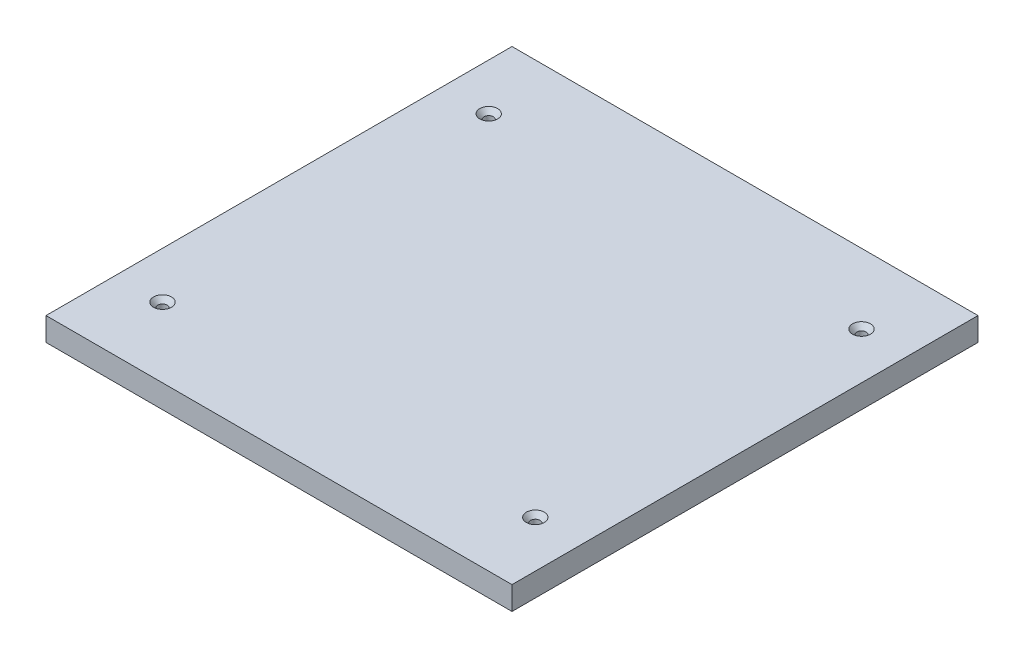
ISO-10303-21;
HEADER;
FILE_DESCRIPTION(('STEP AP214'),'2;1');
FILE_NAME('part.step','',(''),(''),'','','');
FILE_SCHEMA(('AUTOMOTIVE_DESIGN { 1 0 10303 214 1 1 1 1 }'));
ENDSEC;
DATA;
#1=APPLICATION_CONTEXT('core data for automotive mechanical design processes');
#2=APPLICATION_PROTOCOL_DEFINITION('international standard','automotive_design',2000,#1);
#3=PRODUCT_CONTEXT('',#1,'mechanical');
#4=PRODUCT('Part','Part','',(#3));
#5=PRODUCT_RELATED_PRODUCT_CATEGORY('part','',(#4));
#6=PRODUCT_DEFINITION_FORMATION('','',#4);
#7=PRODUCT_DEFINITION_CONTEXT('part definition',#1,'design');
#8=PRODUCT_DEFINITION('design','',#6,#7);
#9=PRODUCT_DEFINITION_SHAPE('','',#8);
#10=(LENGTH_UNIT() NAMED_UNIT(*) SI_UNIT(.MILLI.,.METRE.));
#11=(NAMED_UNIT(*) PLANE_ANGLE_UNIT() SI_UNIT($,.RADIAN.));
#12=(NAMED_UNIT(*) SI_UNIT($,.STERADIAN.) SOLID_ANGLE_UNIT());
#13=UNCERTAINTY_MEASURE_WITH_UNIT(LENGTH_MEASURE(1.E-05),#10,'distance_accuracy_value','');
#14=(GEOMETRIC_REPRESENTATION_CONTEXT(3) GLOBAL_UNCERTAINTY_ASSIGNED_CONTEXT((#13)) GLOBAL_UNIT_ASSIGNED_CONTEXT((#10,
#11,#12)) REPRESENTATION_CONTEXT('',''));
#15=CARTESIAN_POINT('',(0.,0.,0.));
#16=DIRECTION('',(0.,0.,1.));
#17=DIRECTION('',(1.,0.,0.));
#18=AXIS2_PLACEMENT_3D('',#15,#16,#17);
#19=CARTESIAN_POINT('',(127.,12.7,-127.));
#20=DIRECTION('',(-1.,0.,0.));
#21=DIRECTION('',(0.,0.,1.));
#22=AXIS2_PLACEMENT_3D('',#19,#20,#21);
#23=PLANE('',#22);
#24=DIRECTION('',(0.,0.,-1.));
#25=VECTOR('',#24,1.);
#26=CARTESIAN_POINT('',(127.,0.,-127.));
#27=LINE('',#26,#25);
#28=CARTESIAN_POINT('',(127.,0.,127.));
#29=VERTEX_POINT('',#28);
#30=CARTESIAN_POINT('',(127.,0.,-127.));
#31=VERTEX_POINT('',#30);
#32=EDGE_CURVE('E96',#29,#31,#27,.T.);
#33=ORIENTED_EDGE('',*,*,#32,.T.);
#34=DIRECTION('',(0.,-1.,0.));
#35=VECTOR('',#34,1.);
#36=CARTESIAN_POINT('',(127.,12.7,-127.));
#37=LINE('',#36,#35);
#38=CARTESIAN_POINT('',(127.,12.7,-127.));
#39=VERTEX_POINT('',#38);
#40=EDGE_CURVE('E11',#39,#31,#37,.T.);
#41=ORIENTED_EDGE('',*,*,#40,.F.);
#42=DIRECTION('',(0.,0.,-1.));
#43=VECTOR('',#42,1.);
#44=CARTESIAN_POINT('',(127.,12.7,-127.));
#45=LINE('',#44,#43);
#46=CARTESIAN_POINT('',(127.,12.7,127.));
#47=VERTEX_POINT('',#46);
#48=EDGE_CURVE('E84',#47,#39,#45,.T.);
#49=ORIENTED_EDGE('',*,*,#48,.F.);
#50=DIRECTION('',(0.,-1.,0.));
#51=VECTOR('',#50,1.);
#52=CARTESIAN_POINT('',(127.,12.7,127.));
#53=LINE('',#52,#51);
#54=EDGE_CURVE('E92',#47,#29,#53,.T.);
#55=ORIENTED_EDGE('',*,*,#54,.T.);
#56=EDGE_LOOP('',(#33,#41,#49,#55));
#57=FACE_BOUND('',#56,.T.);
#58=ADVANCED_FACE('F33',(#57),#23,.F.);
#59=CARTESIAN_POINT('',(-127.,12.7,-127.));
#60=DIRECTION('',(0.,0.,1.));
#61=DIRECTION('',(1.,0.,0.));
#62=AXIS2_PLACEMENT_3D('',#59,#60,#61);
#63=PLANE('',#62);
#64=DIRECTION('',(-1.,0.,0.));
#65=VECTOR('',#64,1.);
#66=CARTESIAN_POINT('',(-127.,0.,-127.));
#67=LINE('',#66,#65);
#68=CARTESIAN_POINT('',(-127.,0.,-127.));
#69=VERTEX_POINT('',#68);
#70=EDGE_CURVE('E88',#31,#69,#67,.T.);
#71=ORIENTED_EDGE('',*,*,#70,.T.);
#72=DIRECTION('',(0.,-1.,0.));
#73=VECTOR('',#72,1.);
#74=CARTESIAN_POINT('',(-127.,12.7,-127.));
#75=LINE('',#74,#73);
#76=CARTESIAN_POINT('',(-127.,12.7,-127.));
#77=VERTEX_POINT('',#76);
#78=EDGE_CURVE('E41',#77,#69,#75,.T.);
#79=ORIENTED_EDGE('',*,*,#78,.F.);
#80=DIRECTION('',(-1.,0.,0.));
#81=VECTOR('',#80,1.);
#82=CARTESIAN_POINT('',(-127.,12.7,-127.));
#83=LINE('',#82,#81);
#84=EDGE_CURVE('E79',#39,#77,#83,.T.);
#85=ORIENTED_EDGE('',*,*,#84,.F.);
#86=ORIENTED_EDGE('',*,*,#40,.T.);
#87=EDGE_LOOP('',(#71,#79,#85,#86));
#88=FACE_BOUND('',#87,.T.);
#89=ADVANCED_FACE('F87',(#88),#63,.F.);
#90=CARTESIAN_POINT('',(-127.,12.7,-127.));
#91=DIRECTION('',(1.,0.,0.));
#92=DIRECTION('',(0.,0.,-1.));
#93=AXIS2_PLACEMENT_3D('',#90,#91,#92);
#94=PLANE('',#93);
#95=DIRECTION('',(0.,0.,1.));
#96=VECTOR('',#95,1.);
#97=CARTESIAN_POINT('',(-127.,0.,-127.));
#98=LINE('',#97,#96);
#99=CARTESIAN_POINT('',(-127.,0.,127.));
#100=VERTEX_POINT('',#99);
#101=EDGE_CURVE('E66',#69,#100,#98,.T.);
#102=ORIENTED_EDGE('',*,*,#101,.T.);
#103=DIRECTION('',(0.,-1.,0.));
#104=VECTOR('',#103,1.);
#105=CARTESIAN_POINT('',(-127.,12.7,127.));
#106=LINE('',#105,#104);
#107=CARTESIAN_POINT('',(-127.,12.7,127.));
#108=VERTEX_POINT('',#107);
#109=EDGE_CURVE('E89',#108,#100,#106,.T.);
#110=ORIENTED_EDGE('',*,*,#109,.F.);
#111=DIRECTION('',(0.,0.,1.));
#112=VECTOR('',#111,1.);
#113=CARTESIAN_POINT('',(-127.,12.7,-127.));
#114=LINE('',#113,#112);
#115=EDGE_CURVE('E82',#77,#108,#114,.T.);
#116=ORIENTED_EDGE('',*,*,#115,.F.);
#117=ORIENTED_EDGE('',*,*,#78,.T.);
#118=EDGE_LOOP('',(#102,#110,#116,#117));
#119=FACE_BOUND('',#118,.T.);
#120=ADVANCED_FACE('F90',(#119),#94,.F.);
#121=CARTESIAN_POINT('',(-127.,12.7,127.));
#122=DIRECTION('',(0.,0.,-1.));
#123=DIRECTION('',(-1.,0.,0.));
#124=AXIS2_PLACEMENT_3D('',#121,#122,#123);
#125=PLANE('',#124);
#126=DIRECTION('',(1.,0.,0.));
#127=VECTOR('',#126,1.);
#128=CARTESIAN_POINT('',(-127.,0.,127.));
#129=LINE('',#128,#127);
#130=EDGE_CURVE('E72',#100,#29,#129,.T.);
#131=ORIENTED_EDGE('',*,*,#130,.T.);
#132=ORIENTED_EDGE('',*,*,#54,.F.);
#133=DIRECTION('',(1.,0.,0.));
#134=VECTOR('',#133,1.);
#135=CARTESIAN_POINT('',(-127.,12.7,127.));
#136=LINE('',#135,#134);
#137=EDGE_CURVE('E49',#108,#47,#136,.T.);
#138=ORIENTED_EDGE('',*,*,#137,.F.);
#139=ORIENTED_EDGE('',*,*,#109,.T.);
#140=EDGE_LOOP('',(#131,#132,#138,#139));
#141=FACE_BOUND('',#140,.T.);
#142=ADVANCED_FACE('F104',(#141),#125,.F.);
#143=CARTESIAN_POINT('',(0.,12.7,0.));
#144=DIRECTION('',(0.,1.,0.));
#145=DIRECTION('',(0.,0.,1.));
#146=AXIS2_PLACEMENT_3D('',#143,#144,#145);
#147=PLANE('',#146);
#148=CARTESIAN_POINT('',(-101.6,12.7,-88.9));
#149=DIRECTION('',(0.,1.,0.));
#150=DIRECTION('',(0.,0.,1.));
#151=AXIS2_PLACEMENT_3D('',#148,#149,#150);
#152=CIRCLE('',#151,4.88950000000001);
#153=CARTESIAN_POINT('',(-101.6,12.7,-84.0105));
#154=VERTEX_POINT('',#153);
#155=EDGE_CURVE('E142',#154,#154,#152,.T.);
#156=ORIENTED_EDGE('',*,*,#155,.F.);
#157=EDGE_LOOP('',(#156));
#158=FACE_BOUND('',#157,.T.);
#159=CARTESIAN_POINT('',(101.6,12.7,-88.9));
#160=DIRECTION('',(0.,1.,0.));
#161=DIRECTION('',(0.,0.,1.));
#162=AXIS2_PLACEMENT_3D('',#159,#160,#161);
#163=CIRCLE('',#162,4.88950000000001);
#164=CARTESIAN_POINT('',(101.6,12.7,-84.0105));
#165=VERTEX_POINT('',#164);
#166=EDGE_CURVE('E133',#165,#165,#163,.T.);
#167=ORIENTED_EDGE('',*,*,#166,.F.);
#168=EDGE_LOOP('',(#167));
#169=FACE_BOUND('',#168,.T.);
#170=CARTESIAN_POINT('',(-101.6,12.7,88.9));
#171=DIRECTION('',(0.,1.,0.));
#172=DIRECTION('',(0.,0.,1.));
#173=AXIS2_PLACEMENT_3D('',#170,#171,#172);
#174=CIRCLE('',#173,4.88950000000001);
#175=CARTESIAN_POINT('',(-101.6,12.7,93.7895));
#176=VERTEX_POINT('',#175);
#177=EDGE_CURVE('E124',#176,#176,#174,.T.);
#178=ORIENTED_EDGE('',*,*,#177,.F.);
#179=EDGE_LOOP('',(#178));
#180=FACE_BOUND('',#179,.T.);
#181=CARTESIAN_POINT('',(101.6,12.7,88.9));
#182=DIRECTION('',(0.,1.,0.));
#183=DIRECTION('',(0.,0.,1.));
#184=AXIS2_PLACEMENT_3D('',#181,#182,#183);
#185=CIRCLE('',#184,4.88950000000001);
#186=CARTESIAN_POINT('',(101.6,12.7,93.7895));
#187=VERTEX_POINT('',#186);
#188=EDGE_CURVE('E115',#187,#187,#185,.T.);
#189=ORIENTED_EDGE('',*,*,#188,.F.);
#190=EDGE_LOOP('',(#189));
#191=FACE_BOUND('',#190,.T.);
#192=ORIENTED_EDGE('',*,*,#48,.T.);
#193=ORIENTED_EDGE('',*,*,#84,.T.);
#194=ORIENTED_EDGE('',*,*,#115,.T.);
#195=ORIENTED_EDGE('',*,*,#137,.T.);
#196=EDGE_LOOP('',(#192,#193,#194,#195));
#197=FACE_BOUND('',#196,.T.);
#198=ADVANCED_FACE('F80',(#158,#169,#180,#191,#197),#147,.T.);
#199=CARTESIAN_POINT('',(0.,0.,0.));
#200=DIRECTION('',(0.,1.,0.));
#201=DIRECTION('',(0.,0.,1.));
#202=AXIS2_PLACEMENT_3D('',#199,#200,#201);
#203=PLANE('',#202);
#204=CARTESIAN_POINT('',(-101.6,0.,-88.9));
#205=DIRECTION('',(0.,1.,0.));
#206=DIRECTION('',(0.,0.,1.));
#207=AXIS2_PLACEMENT_3D('',#204,#205,#206);
#208=CIRCLE('',#207,2.55269999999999);
#209=CARTESIAN_POINT('',(-101.6,0.,-86.3473));
#210=VERTEX_POINT('',#209);
#211=EDGE_CURVE('E136',#210,#210,#208,.T.);
#212=ORIENTED_EDGE('',*,*,#211,.T.);
#213=EDGE_LOOP('',(#212));
#214=FACE_BOUND('',#213,.T.);
#215=CARTESIAN_POINT('',(101.6,0.,-88.9));
#216=DIRECTION('',(0.,1.,0.));
#217=DIRECTION('',(0.,0.,1.));
#218=AXIS2_PLACEMENT_3D('',#215,#216,#217);
#219=CIRCLE('',#218,2.55269999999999);
#220=CARTESIAN_POINT('',(101.6,0.,-86.3473));
#221=VERTEX_POINT('',#220);
#222=EDGE_CURVE('E127',#221,#221,#219,.T.);
#223=ORIENTED_EDGE('',*,*,#222,.T.);
#224=EDGE_LOOP('',(#223));
#225=FACE_BOUND('',#224,.T.);
#226=CARTESIAN_POINT('',(-101.6,0.,88.9));
#227=DIRECTION('',(0.,1.,0.));
#228=DIRECTION('',(0.,0.,1.));
#229=AXIS2_PLACEMENT_3D('',#226,#227,#228);
#230=CIRCLE('',#229,2.55269999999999);
#231=CARTESIAN_POINT('',(-101.6,0.,91.4527));
#232=VERTEX_POINT('',#231);
#233=EDGE_CURVE('E118',#232,#232,#230,.T.);
#234=ORIENTED_EDGE('',*,*,#233,.T.);
#235=EDGE_LOOP('',(#234));
#236=FACE_BOUND('',#235,.T.);
#237=CARTESIAN_POINT('',(101.6,0.,88.9));
#238=DIRECTION('',(0.,1.,0.));
#239=DIRECTION('',(0.,0.,1.));
#240=AXIS2_PLACEMENT_3D('',#237,#238,#239);
#241=CIRCLE('',#240,2.55269999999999);
#242=CARTESIAN_POINT('',(101.6,0.,91.4527));
#243=VERTEX_POINT('',#242);
#244=EDGE_CURVE('E99',#243,#243,#241,.T.);
#245=ORIENTED_EDGE('',*,*,#244,.T.);
#246=EDGE_LOOP('',(#245));
#247=FACE_BOUND('',#246,.T.);
#248=ORIENTED_EDGE('',*,*,#32,.F.);
#249=ORIENTED_EDGE('',*,*,#130,.F.);
#250=ORIENTED_EDGE('',*,*,#101,.F.);
#251=ORIENTED_EDGE('',*,*,#70,.F.);
#252=EDGE_LOOP('',(#248,#249,#250,#251));
#253=FACE_BOUND('',#252,.T.);
#254=ADVANCED_FACE('F107',(#214,#225,#236,#247,#253),#203,.F.);
#255=CARTESIAN_POINT('',(101.6,12.7,88.9));
#256=DIRECTION('',(0.,1.,0.));
#257=DIRECTION('',(0.,0.,1.));
#258=AXIS2_PLACEMENT_3D('',#255,#256,#257);
#259=CYLINDRICAL_SURFACE('',#258,2.5527);
#260=ORIENTED_EDGE('',*,*,#244,.F.);
#261=EDGE_LOOP('',(#260));
#262=FACE_BOUND('',#261,.T.);
#263=CARTESIAN_POINT('',(101.6,10.0118191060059,88.9));
#264=DIRECTION('',(0.,1.,0.));
#265=DIRECTION('',(0.,0.,1.));
#266=AXIS2_PLACEMENT_3D('',#263,#264,#265);
#267=CIRCLE('',#266,2.55270000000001);
#268=CARTESIAN_POINT('',(101.6,10.0118191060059,91.4527));
#269=VERTEX_POINT('',#268);
#270=EDGE_CURVE('E112',#269,#269,#267,.T.);
#271=ORIENTED_EDGE('',*,*,#270,.T.);
#272=EDGE_LOOP('',(#271));
#273=FACE_BOUND('',#272,.T.);
#274=ADVANCED_FACE('F160',(#262,#273),#259,.F.);
#275=CARTESIAN_POINT('',(101.6,12.7,88.9));
#276=DIRECTION('',(0.,1.,0.));
#277=DIRECTION('',(0.,0.,1.));
#278=AXIS2_PLACEMENT_3D('',#275,#276,#277);
#279=CONICAL_SURFACE('',#278,4.88950000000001,0.715584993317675);
#280=ORIENTED_EDGE('',*,*,#270,.F.);
#281=EDGE_LOOP('',(#280));
#282=FACE_BOUND('',#281,.T.);
#283=ORIENTED_EDGE('',*,*,#188,.T.);
#284=EDGE_LOOP('',(#283));
#285=FACE_BOUND('',#284,.T.);
#286=ADVANCED_FACE('F157',(#282,#285),#279,.F.);
#287=CARTESIAN_POINT('',(-101.6,12.7,88.9));
#288=DIRECTION('',(0.,1.,0.));
#289=DIRECTION('',(0.,0.,1.));
#290=AXIS2_PLACEMENT_3D('',#287,#288,#289);
#291=CYLINDRICAL_SURFACE('',#290,2.5527);
#292=ORIENTED_EDGE('',*,*,#233,.F.);
#293=EDGE_LOOP('',(#292));
#294=FACE_BOUND('',#293,.T.);
#295=CARTESIAN_POINT('',(-101.6,10.0118191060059,88.9));
#296=DIRECTION('',(0.,1.,0.));
#297=DIRECTION('',(0.,0.,1.));
#298=AXIS2_PLACEMENT_3D('',#295,#296,#297);
#299=CIRCLE('',#298,2.55270000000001);
#300=CARTESIAN_POINT('',(-101.6,10.0118191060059,91.4527));
#301=VERTEX_POINT('',#300);
#302=EDGE_CURVE('E121',#301,#301,#299,.T.);
#303=ORIENTED_EDGE('',*,*,#302,.T.);
#304=EDGE_LOOP('',(#303));
#305=FACE_BOUND('',#304,.T.);
#306=ADVANCED_FACE('F159',(#294,#305),#291,.F.);
#307=CARTESIAN_POINT('',(-101.6,12.7,88.9));
#308=DIRECTION('',(0.,1.,0.));
#309=DIRECTION('',(0.,0.,1.));
#310=AXIS2_PLACEMENT_3D('',#307,#308,#309);
#311=CONICAL_SURFACE('',#310,4.88950000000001,0.715584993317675);
#312=ORIENTED_EDGE('',*,*,#302,.F.);
#313=EDGE_LOOP('',(#312));
#314=FACE_BOUND('',#313,.T.);
#315=ORIENTED_EDGE('',*,*,#177,.T.);
#316=EDGE_LOOP('',(#315));
#317=FACE_BOUND('',#316,.T.);
#318=ADVANCED_FACE('F167',(#314,#317),#311,.F.);
#319=CARTESIAN_POINT('',(101.6,12.7,-88.9));
#320=DIRECTION('',(0.,1.,0.));
#321=DIRECTION('',(0.,0.,1.));
#322=AXIS2_PLACEMENT_3D('',#319,#320,#321);
#323=CYLINDRICAL_SURFACE('',#322,2.5527);
#324=ORIENTED_EDGE('',*,*,#222,.F.);
#325=EDGE_LOOP('',(#324));
#326=FACE_BOUND('',#325,.T.);
#327=CARTESIAN_POINT('',(101.6,10.0118191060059,-88.9));
#328=DIRECTION('',(0.,1.,0.));
#329=DIRECTION('',(0.,0.,1.));
#330=AXIS2_PLACEMENT_3D('',#327,#328,#329);
#331=CIRCLE('',#330,2.55270000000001);
#332=CARTESIAN_POINT('',(101.6,10.0118191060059,-86.3473));
#333=VERTEX_POINT('',#332);
#334=EDGE_CURVE('E130',#333,#333,#331,.T.);
#335=ORIENTED_EDGE('',*,*,#334,.T.);
#336=EDGE_LOOP('',(#335));
#337=FACE_BOUND('',#336,.T.);
#338=ADVANCED_FACE('F201',(#326,#337),#323,.F.);
#339=CARTESIAN_POINT('',(101.6,12.7,-88.9));
#340=DIRECTION('',(0.,1.,0.));
#341=DIRECTION('',(0.,0.,1.));
#342=AXIS2_PLACEMENT_3D('',#339,#340,#341);
#343=CONICAL_SURFACE('',#342,4.88950000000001,0.715584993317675);
#344=ORIENTED_EDGE('',*,*,#334,.F.);
#345=EDGE_LOOP('',(#344));
#346=FACE_BOUND('',#345,.T.);
#347=ORIENTED_EDGE('',*,*,#166,.T.);
#348=EDGE_LOOP('',(#347));
#349=FACE_BOUND('',#348,.T.);
#350=ADVANCED_FACE('F206',(#346,#349),#343,.F.);
#351=CARTESIAN_POINT('',(-101.6,12.7,-88.9));
#352=DIRECTION('',(0.,1.,0.));
#353=DIRECTION('',(0.,0.,1.));
#354=AXIS2_PLACEMENT_3D('',#351,#352,#353);
#355=CYLINDRICAL_SURFACE('',#354,2.5527);
#356=ORIENTED_EDGE('',*,*,#211,.F.);
#357=EDGE_LOOP('',(#356));
#358=FACE_BOUND('',#357,.T.);
#359=CARTESIAN_POINT('',(-101.6,10.0118191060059,-88.9));
#360=DIRECTION('',(0.,1.,0.));
#361=DIRECTION('',(0.,0.,1.));
#362=AXIS2_PLACEMENT_3D('',#359,#360,#361);
#363=CIRCLE('',#362,2.55270000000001);
#364=CARTESIAN_POINT('',(-101.6,10.0118191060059,-86.3473));
#365=VERTEX_POINT('',#364);
#366=EDGE_CURVE('E139',#365,#365,#363,.T.);
#367=ORIENTED_EDGE('',*,*,#366,.T.);
#368=EDGE_LOOP('',(#367));
#369=FACE_BOUND('',#368,.T.);
#370=ADVANCED_FACE('F212',(#358,#369),#355,.F.);
#371=CARTESIAN_POINT('',(-101.6,12.7,-88.9));
#372=DIRECTION('',(0.,1.,0.));
#373=DIRECTION('',(0.,0.,1.));
#374=AXIS2_PLACEMENT_3D('',#371,#372,#373);
#375=CONICAL_SURFACE('',#374,4.88950000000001,0.715584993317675);
#376=ORIENTED_EDGE('',*,*,#366,.F.);
#377=EDGE_LOOP('',(#376));
#378=FACE_BOUND('',#377,.T.);
#379=ORIENTED_EDGE('',*,*,#155,.T.);
#380=EDGE_LOOP('',(#379));
#381=FACE_BOUND('',#380,.T.);
#382=ADVANCED_FACE('F146',(#378,#381),#375,.F.);
#383=CLOSED_SHELL('',(#58,#89,#120,#142,#198,#254,#274,#286,#306,#318,#338,#350,#370,#382));
#384=MANIFOLD_SOLID_BREP('B2',#383);
#385=ADVANCED_BREP_SHAPE_REPRESENTATION('',(#18,#384),#14);
#386=SHAPE_DEFINITION_REPRESENTATION(#9,#385);
ENDSEC;
END-ISO-10303-21;
